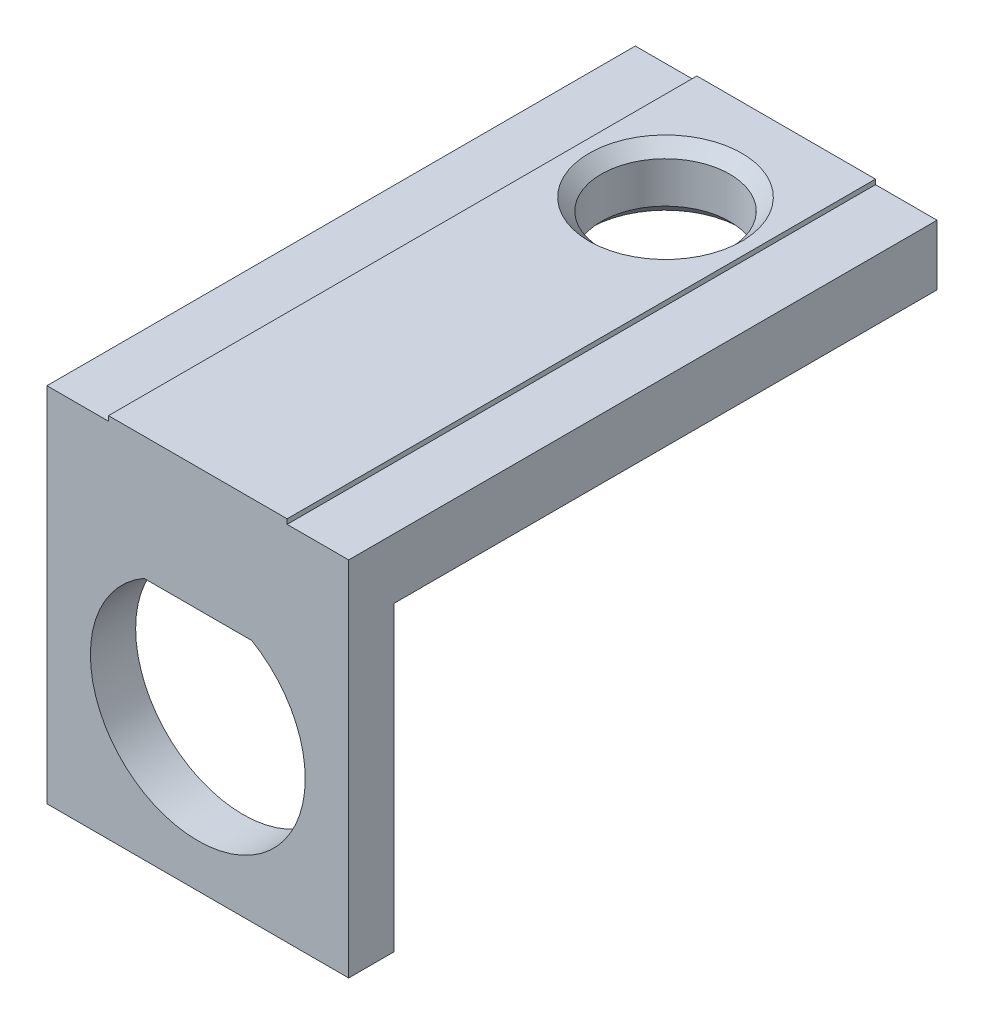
from build123d import *

# Parameters (mm, degrees)
SKETCH1_W           = 15.875
SKETCH1_H           = 22.225
BOSS_EXTRUDE1_DEPTH = 2.38125
SKETCH2_W           = 15.875
SKETCH2_H           = 3.175
BOSS_EXTRUDE2_DEPTH = 28.575
SKETCH12_W          = 15.875
SKETCH12_H          = 3.175
CUT_EXTRUDE1_DEPTH  = 32.670525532
SKETCH15_W          = 9.398
SKETCH15_H          = 30.95625
BOSS_EXTRUDE7_DEPTH = 0.254


with BuildPart() as part:
    # Sketch1 → Boss-Extrude1 (new body)
    with BuildSketch(Plane.XY):
        Rectangle(SKETCH1_W, SKETCH1_H)
        with BuildLine():
            Line((-2.834121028, 4.8895), (2.834121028, 4.8895))
            ThreePointArc((2.834121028, 4.8895), (0, -5.6515), (-2.834121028, 4.8895))
        make_face(mode=Mode.SUBTRACT)
    extrude(amount=BOSS_EXTRUDE1_DEPTH)

    # Sketch2 → Boss-Extrude2 (add)
    with BuildSketch(Plane(origin=(0, 0, 0), x_dir=(-1, 0, 0), z_dir=(0, 0, -1))):
        with Locations((0, 9.525)):
            Rectangle(SKETCH2_W, SKETCH2_H)
    extrude(amount=BOSS_EXTRUDE2_DEPTH)

    # Sketch12 → Cut-Extrude1 (cut, through all)
    with BuildSketch(Plane(origin=(0, 0, 0), x_dir=(-1, 0, 0), z_dir=(0, 0, -1))):
        with Locations((0, -9.525)):
            Rectangle(SKETCH12_W, SKETCH12_H)
    extrude(amount=-CUT_EXTRUDE1_DEPTH, mode=Mode.SUBTRACT)

    # Sketch15 → Boss-Extrude7 (add)
    with BuildSketch(Plane(origin=(0, 11.1125, 0), x_dir=(1, 0, 0), z_dir=(0, 1, 0))):
        with Locations((0, 13.096875)):
            Rectangle(SKETCH15_W, SKETCH15_H)
    extrude(amount=BOSS_EXTRUDE7_DEPTH)

    # Sketch18 → 1_4 Clearance Hole1 (revolve, cut)
    with BuildSketch(Plane(origin=(0, 11.3665, -22.225), x_dir=(0, 0, 1), z_dir=(1, 0, 0))):
        Polygon((0, 0), (0, 3.429), (4.0132, 3.429), (3.3782, 2.794), (3.3782, 0.635), (4.0132, 0), align=None)
    revolve(axis=Axis((0, 17.7165, -22.225), (0, -1, 0)), mode=Mode.SUBTRACT)


solid = part.part
